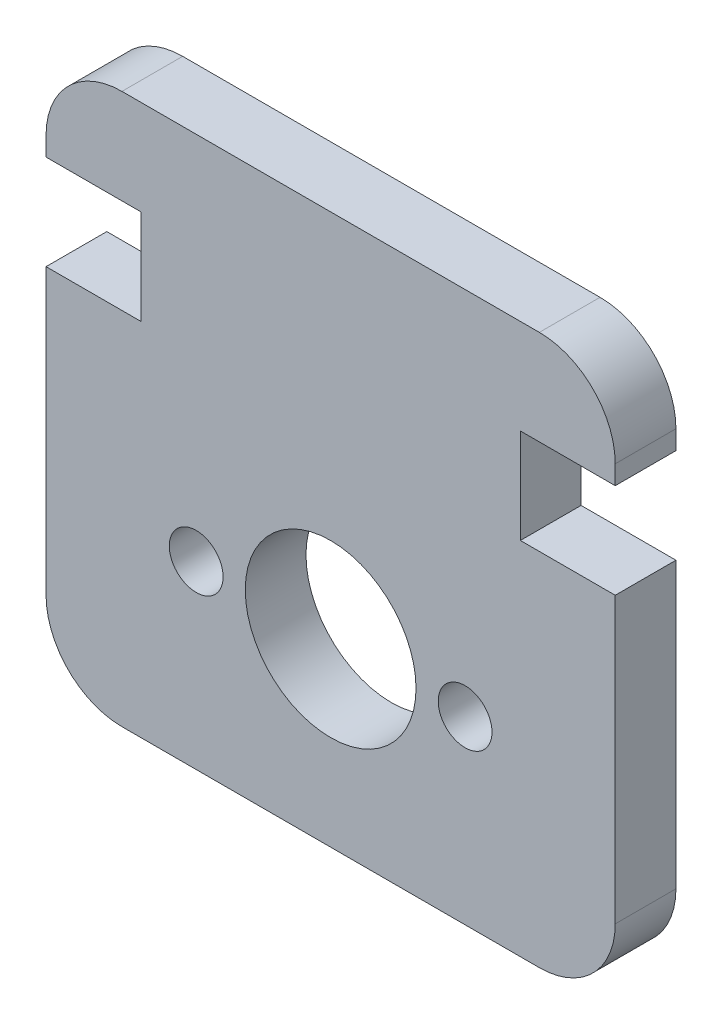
ISO-10303-21;
HEADER;
FILE_DESCRIPTION(('STEP AP214'),'2;1');
FILE_NAME('part.step','',(''),(''),'','','');
FILE_SCHEMA(('AUTOMOTIVE_DESIGN { 1 0 10303 214 1 1 1 1 }'));
ENDSEC;
DATA;
#1=APPLICATION_CONTEXT('core data for automotive mechanical design processes');
#2=APPLICATION_PROTOCOL_DEFINITION('international standard','automotive_design',2000,#1);
#3=PRODUCT_CONTEXT('',#1,'mechanical');
#4=PRODUCT('Part','Part','',(#3));
#5=PRODUCT_RELATED_PRODUCT_CATEGORY('part','',(#4));
#6=PRODUCT_DEFINITION_FORMATION('','',#4);
#7=PRODUCT_DEFINITION_CONTEXT('part definition',#1,'design');
#8=PRODUCT_DEFINITION('design','',#6,#7);
#9=PRODUCT_DEFINITION_SHAPE('','',#8);
#10=(LENGTH_UNIT() NAMED_UNIT(*) SI_UNIT(.MILLI.,.METRE.));
#11=(NAMED_UNIT(*) PLANE_ANGLE_UNIT() SI_UNIT($,.RADIAN.));
#12=(NAMED_UNIT(*) SI_UNIT($,.STERADIAN.) SOLID_ANGLE_UNIT());
#13=UNCERTAINTY_MEASURE_WITH_UNIT(LENGTH_MEASURE(1.E-05),#10,'distance_accuracy_value','');
#14=(GEOMETRIC_REPRESENTATION_CONTEXT(3) GLOBAL_UNCERTAINTY_ASSIGNED_CONTEXT((#13)) GLOBAL_UNIT_ASSIGNED_CONTEXT((#10,
#11,#12)) REPRESENTATION_CONTEXT('',''));
#15=CARTESIAN_POINT('',(0.,0.,0.));
#16=DIRECTION('',(0.,0.,1.));
#17=DIRECTION('',(1.,0.,0.));
#18=AXIS2_PLACEMENT_3D('',#15,#16,#17);
#19=CARTESIAN_POINT('',(9.525,7.62,1.016));
#20=DIRECTION('',(-1.,0.,0.));
#21=DIRECTION('',(0.,-1.,0.));
#22=AXIS2_PLACEMENT_3D('',#19,#20,#21);
#23=PLANE('',#22);
#24=DIRECTION('',(0.,1.,0.));
#25=VECTOR('',#24,1.);
#26=CARTESIAN_POINT('',(9.525,7.62,1.016));
#27=LINE('',#26,#25);
#28=CARTESIAN_POINT('',(9.525,-5.07999999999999,1.016));
#29=VERTEX_POINT('',#28);
#30=CARTESIAN_POINT('',(9.525,4.445,1.016));
#31=VERTEX_POINT('',#30);
#32=EDGE_CURVE('E276',#29,#31,#27,.T.);
#33=ORIENTED_EDGE('',*,*,#32,.F.);
#34=DIRECTION('',(0.,0.,-1.));
#35=VECTOR('',#34,1.);
#36=CARTESIAN_POINT('',(9.525,-5.08,1.016));
#37=LINE('',#36,#35);
#38=CARTESIAN_POINT('',(9.525,-5.07999999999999,-1.016));
#39=VERTEX_POINT('',#38);
#40=EDGE_CURVE('E284',#29,#39,#37,.T.);
#41=ORIENTED_EDGE('',*,*,#40,.T.);
#42=DIRECTION('',(0.,1.,0.));
#43=VECTOR('',#42,1.);
#44=CARTESIAN_POINT('',(9.525,7.62,-1.016));
#45=LINE('',#44,#43);
#46=CARTESIAN_POINT('',(9.525,4.445,-1.016));
#47=VERTEX_POINT('',#46);
#48=EDGE_CURVE('E272',#39,#47,#45,.T.);
#49=ORIENTED_EDGE('',*,*,#48,.T.);
#50=DIRECTION('',(0.,0.,1.));
#51=VECTOR('',#50,1.);
#52=CARTESIAN_POINT('',(9.525,4.445,-1.016));
#53=LINE('',#52,#51);
#54=EDGE_CURVE('E235',#47,#31,#53,.T.);
#55=ORIENTED_EDGE('',*,*,#54,.T.);
#56=EDGE_LOOP('',(#33,#41,#49,#55));
#57=FACE_BOUND('',#56,.T.);
#58=ADVANCED_FACE('F31',(#57),#23,.F.);
#59=CARTESIAN_POINT('',(-9.525,7.62,1.016));
#60=DIRECTION('',(1.,0.,0.));
#61=DIRECTION('',(0.,1.,0.));
#62=AXIS2_PLACEMENT_3D('',#59,#60,#61);
#63=PLANE('',#62);
#64=DIRECTION('',(0.,-1.,0.));
#65=VECTOR('',#64,1.);
#66=CARTESIAN_POINT('',(-9.525,7.62,-1.016));
#67=LINE('',#66,#65);
#68=CARTESIAN_POINT('',(-9.525,4.445,-1.016));
#69=VERTEX_POINT('',#68);
#70=CARTESIAN_POINT('',(-9.525,-5.08,-1.016));
#71=VERTEX_POINT('',#70);
#72=EDGE_CURVE('E286',#69,#71,#67,.T.);
#73=ORIENTED_EDGE('',*,*,#72,.T.);
#74=DIRECTION('',(0.,0.,-1.));
#75=VECTOR('',#74,1.);
#76=CARTESIAN_POINT('',(-9.525,-5.08,1.016));
#77=LINE('',#76,#75);
#78=CARTESIAN_POINT('',(-9.525,-5.08,1.016));
#79=VERTEX_POINT('',#78);
#80=EDGE_CURVE('E305',#71,#79,#77,.F.);
#81=ORIENTED_EDGE('',*,*,#80,.T.);
#82=DIRECTION('',(0.,-1.,0.));
#83=VECTOR('',#82,1.);
#84=CARTESIAN_POINT('',(-9.525,7.62,1.016));
#85=LINE('',#84,#83);
#86=CARTESIAN_POINT('',(-9.525,4.445,1.016));
#87=VERTEX_POINT('',#86);
#88=EDGE_CURVE('E278',#87,#79,#85,.T.);
#89=ORIENTED_EDGE('',*,*,#88,.F.);
#90=DIRECTION('',(0.,0.,1.));
#91=VECTOR('',#90,1.);
#92=CARTESIAN_POINT('',(-9.525,4.445,-1.016));
#93=LINE('',#92,#91);
#94=EDGE_CURVE('E245',#69,#87,#93,.T.);
#95=ORIENTED_EDGE('',*,*,#94,.F.);
#96=EDGE_LOOP('',(#73,#81,#89,#95));
#97=FACE_BOUND('',#96,.T.);
#98=ADVANCED_FACE('F309',(#97),#63,.F.);
#99=CARTESIAN_POINT('',(-9.525,-7.62,1.016));
#100=DIRECTION('',(0.,1.,0.));
#101=DIRECTION('',(0.,0.,1.));
#102=AXIS2_PLACEMENT_3D('',#99,#100,#101);
#103=PLANE('',#102);
#104=DIRECTION('',(1.,0.,0.));
#105=VECTOR('',#104,1.);
#106=CARTESIAN_POINT('',(-9.525,-7.62,-1.016));
#107=LINE('',#106,#105);
#108=CARTESIAN_POINT('',(-6.985,-7.62,-1.016));
#109=VERTEX_POINT('',#108);
#110=CARTESIAN_POINT('',(6.985,-7.62,-1.016));
#111=VERTEX_POINT('',#110);
#112=EDGE_CURVE('E279',#109,#111,#107,.T.);
#113=ORIENTED_EDGE('',*,*,#112,.T.);
#114=DIRECTION('',(0.,0.,-1.));
#115=VECTOR('',#114,1.);
#116=CARTESIAN_POINT('',(6.985,-7.62,1.016));
#117=LINE('',#116,#115);
#118=CARTESIAN_POINT('',(6.985,-7.62,1.016));
#119=VERTEX_POINT('',#118);
#120=EDGE_CURVE('E300',#111,#119,#117,.F.);
#121=ORIENTED_EDGE('',*,*,#120,.T.);
#122=DIRECTION('',(1.,0.,0.));
#123=VECTOR('',#122,1.);
#124=CARTESIAN_POINT('',(-9.525,-7.62,1.016));
#125=LINE('',#124,#123);
#126=CARTESIAN_POINT('',(-6.985,-7.62,1.016));
#127=VERTEX_POINT('',#126);
#128=EDGE_CURVE('E281',#127,#119,#125,.T.);
#129=ORIENTED_EDGE('',*,*,#128,.F.);
#130=DIRECTION('',(0.,0.,-1.));
#131=VECTOR('',#130,1.);
#132=CARTESIAN_POINT('',(-6.985,-7.62,1.016));
#133=LINE('',#132,#131);
#134=EDGE_CURVE('E297',#127,#109,#133,.T.);
#135=ORIENTED_EDGE('',*,*,#134,.T.);
#136=EDGE_LOOP('',(#113,#121,#129,#135));
#137=FACE_BOUND('',#136,.T.);
#138=ADVANCED_FACE('F319',(#137),#103,.F.);
#139=CARTESIAN_POINT('',(9.52500000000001,-7.62,1.016));
#140=DIRECTION('',(0.,0.,1.));
#141=DIRECTION('',(1.,0.,0.));
#142=AXIS2_PLACEMENT_3D('',#139,#140,#141);
#143=PLANE('',#142);
#144=CARTESIAN_POINT('',(-4.4999999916,-1.5875,1.016));
#145=DIRECTION('',(0.,0.,1.));
#146=DIRECTION('',(1.,0.,0.));
#147=AXIS2_PLACEMENT_3D('',#144,#145,#146);
#148=CIRCLE('',#147,0.899999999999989);
#149=CARTESIAN_POINT('',(-3.59999999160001,-1.5875,1.016));
#150=VERTEX_POINT('',#149);
#151=EDGE_CURVE('E192',#150,#150,#148,.T.);
#152=ORIENTED_EDGE('',*,*,#151,.F.);
#153=EDGE_LOOP('',(#152));
#154=FACE_BOUND('',#153,.T.);
#155=CARTESIAN_POINT('',(4.500000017,-1.5875,1.016));
#156=DIRECTION('',(0.,0.,1.));
#157=DIRECTION('',(1.,0.,0.));
#158=AXIS2_PLACEMENT_3D('',#155,#156,#157);
#159=CIRCLE('',#158,0.899999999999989);
#160=CARTESIAN_POINT('',(5.40000001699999,-1.5875,1.016));
#161=VERTEX_POINT('',#160);
#162=EDGE_CURVE('E343',#161,#161,#159,.T.);
#163=ORIENTED_EDGE('',*,*,#162,.F.);
#164=EDGE_LOOP('',(#163));
#165=FACE_BOUND('',#164,.T.);
#166=DIRECTION('',(-1.,0.,0.));
#167=VECTOR('',#166,1.);
#168=CARTESIAN_POINT('',(-9.525,10.795,1.016));
#169=LINE('',#168,#167);
#170=CARTESIAN_POINT('',(6.98499999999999,10.795,1.016));
#171=VERTEX_POINT('',#170);
#172=CARTESIAN_POINT('',(-6.985,10.795,1.016));
#173=VERTEX_POINT('',#172);
#174=EDGE_CURVE('E153',#171,#173,#169,.T.);
#175=ORIENTED_EDGE('',*,*,#174,.T.);
#176=CARTESIAN_POINT('',(-6.985,8.255,1.016));
#177=DIRECTION('',(0.,0.,1.));
#178=DIRECTION('',(1.,0.,0.));
#179=AXIS2_PLACEMENT_3D('',#176,#177,#178);
#180=CIRCLE('',#179,2.54);
#181=CARTESIAN_POINT('',(-9.525,8.255,1.016));
#182=VERTEX_POINT('',#181);
#183=EDGE_CURVE('E210',#173,#182,#180,.T.);
#184=ORIENTED_EDGE('',*,*,#183,.T.);
#185=DIRECTION('',(0.,-1.,0.));
#186=VECTOR('',#185,1.);
#187=CARTESIAN_POINT('',(-9.525,7.62,1.016));
#188=LINE('',#187,#186);
#189=CARTESIAN_POINT('',(-9.525,7.62,1.016));
#190=VERTEX_POINT('',#189);
#191=EDGE_CURVE('E184',#182,#190,#188,.T.);
#192=ORIENTED_EDGE('',*,*,#191,.T.);
#193=DIRECTION('',(1.,0.,0.));
#194=VECTOR('',#193,1.);
#195=CARTESIAN_POINT('',(-9.525,7.62,1.016));
#196=LINE('',#195,#194);
#197=CARTESIAN_POINT('',(-6.35,7.62,1.016));
#198=VERTEX_POINT('',#197);
#199=EDGE_CURVE('E161',#190,#198,#196,.T.);
#200=ORIENTED_EDGE('',*,*,#199,.T.);
#201=DIRECTION('',(0.,1.,0.));
#202=VECTOR('',#201,1.);
#203=CARTESIAN_POINT('',(-6.35,7.62,1.016));
#204=LINE('',#203,#202);
#205=CARTESIAN_POINT('',(-6.35,4.445,1.016));
#206=VERTEX_POINT('',#205);
#207=EDGE_CURVE('E226',#206,#198,#204,.T.);
#208=ORIENTED_EDGE('',*,*,#207,.F.);
#209=DIRECTION('',(1.,0.,0.));
#210=VECTOR('',#209,1.);
#211=CARTESIAN_POINT('',(-9.525,4.445,1.016));
#212=LINE('',#211,#210);
#213=EDGE_CURVE('E229',#87,#206,#212,.T.);
#214=ORIENTED_EDGE('',*,*,#213,.F.);
#215=ORIENTED_EDGE('',*,*,#88,.T.);
#216=CARTESIAN_POINT('',(-6.985,-5.08,1.016));
#217=DIRECTION('',(0.,0.,1.));
#218=DIRECTION('',(1.,0.,0.));
#219=AXIS2_PLACEMENT_3D('',#216,#217,#218);
#220=CIRCLE('',#219,2.54);
#221=EDGE_CURVE('E302',#79,#127,#220,.T.);
#222=ORIENTED_EDGE('',*,*,#221,.T.);
#223=ORIENTED_EDGE('',*,*,#128,.T.);
#224=CARTESIAN_POINT('',(6.985,-5.08,1.016));
#225=DIRECTION('',(0.,0.,1.));
#226=DIRECTION('',(1.,0.,0.));
#227=AXIS2_PLACEMENT_3D('',#224,#225,#226);
#228=CIRCLE('',#227,2.54);
#229=EDGE_CURVE('E304',#119,#29,#228,.T.);
#230=ORIENTED_EDGE('',*,*,#229,.T.);
#231=ORIENTED_EDGE('',*,*,#32,.T.);
#232=DIRECTION('',(1.,0.,0.));
#233=VECTOR('',#232,1.);
#234=CARTESIAN_POINT('',(9.525,4.445,1.016));
#235=LINE('',#234,#233);
#236=CARTESIAN_POINT('',(6.35,4.445,1.016));
#237=VERTEX_POINT('',#236);
#238=EDGE_CURVE('E252',#237,#31,#235,.T.);
#239=ORIENTED_EDGE('',*,*,#238,.F.);
#240=DIRECTION('',(0.,-1.,0.));
#241=VECTOR('',#240,1.);
#242=CARTESIAN_POINT('',(6.35,7.62,1.016));
#243=LINE('',#242,#241);
#244=CARTESIAN_POINT('',(6.35,7.62,1.016));
#245=VERTEX_POINT('',#244);
#246=EDGE_CURVE('E259',#245,#237,#243,.T.);
#247=ORIENTED_EDGE('',*,*,#246,.F.);
#248=CARTESIAN_POINT('',(9.525,7.62,1.016));
#249=VERTEX_POINT('',#248);
#250=EDGE_CURVE('E175',#245,#249,#196,.T.);
#251=ORIENTED_EDGE('',*,*,#250,.T.);
#252=DIRECTION('',(0.,1.,0.));
#253=VECTOR('',#252,1.);
#254=CARTESIAN_POINT('',(9.525,7.62,1.016));
#255=LINE('',#254,#253);
#256=CARTESIAN_POINT('',(9.525,8.255,1.016));
#257=VERTEX_POINT('',#256);
#258=EDGE_CURVE('E187',#249,#257,#255,.T.);
#259=ORIENTED_EDGE('',*,*,#258,.T.);
#260=CARTESIAN_POINT('',(6.985,8.255,1.016));
#261=DIRECTION('',(0.,0.,1.));
#262=DIRECTION('',(1.,0.,0.));
#263=AXIS2_PLACEMENT_3D('',#260,#261,#262);
#264=CIRCLE('',#263,2.54);
#265=EDGE_CURVE('E200',#257,#171,#264,.T.);
#266=ORIENTED_EDGE('',*,*,#265,.T.);
#267=EDGE_LOOP('',(#175,#184,#192,#200,#208,#214,#215,#222,#223,#230,#231,#239,#247,#251,#259,#266));
#268=FACE_BOUND('',#267,.T.);
#269=CARTESIAN_POINT('',(0.,-1.5875,1.016));
#270=DIRECTION('',(0.,0.,1.));
#271=DIRECTION('',(1.,0.,0.));
#272=AXIS2_PLACEMENT_3D('',#269,#270,#271);
#273=CIRCLE('',#272,2.8575);
#274=CARTESIAN_POINT('',(2.8575,-1.5875,1.016));
#275=VERTEX_POINT('',#274);
#276=EDGE_CURVE('E273',#275,#275,#273,.T.);
#277=ORIENTED_EDGE('',*,*,#276,.F.);
#278=EDGE_LOOP('',(#277));
#279=FACE_BOUND('',#278,.T.);
#280=ADVANCED_FACE('F198',(#154,#165,#268,#279),#143,.T.);
#281=CARTESIAN_POINT('',(9.52500000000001,-7.62,-1.016));
#282=DIRECTION('',(0.,0.,1.));
#283=DIRECTION('',(1.,0.,0.));
#284=AXIS2_PLACEMENT_3D('',#281,#282,#283);
#285=PLANE('',#284);
#286=CARTESIAN_POINT('',(-4.4999999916,-1.5875,-1.016));
#287=DIRECTION('',(0.,0.,1.));
#288=DIRECTION('',(1.,0.,0.));
#289=AXIS2_PLACEMENT_3D('',#286,#287,#288);
#290=CIRCLE('',#289,0.9);
#291=CARTESIAN_POINT('',(-3.5999999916,-1.5875,-1.016));
#292=VERTEX_POINT('',#291);
#293=EDGE_CURVE('E346',#292,#292,#290,.T.);
#294=ORIENTED_EDGE('',*,*,#293,.T.);
#295=EDGE_LOOP('',(#294));
#296=FACE_BOUND('',#295,.T.);
#297=CARTESIAN_POINT('',(4.500000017,-1.5875,-1.016));
#298=DIRECTION('',(0.,0.,1.));
#299=DIRECTION('',(1.,0.,0.));
#300=AXIS2_PLACEMENT_3D('',#297,#298,#299);
#301=CIRCLE('',#300,0.9);
#302=CARTESIAN_POINT('',(5.400000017,-1.5875,-1.016));
#303=VERTEX_POINT('',#302);
#304=EDGE_CURVE('E338',#303,#303,#301,.T.);
#305=ORIENTED_EDGE('',*,*,#304,.T.);
#306=EDGE_LOOP('',(#305));
#307=FACE_BOUND('',#306,.T.);
#308=CARTESIAN_POINT('',(0.,-1.5875,-1.016));
#309=DIRECTION('',(0.,0.,1.));
#310=DIRECTION('',(1.,0.,0.));
#311=AXIS2_PLACEMENT_3D('',#308,#309,#310);
#312=CIRCLE('',#311,2.8575);
#313=CARTESIAN_POINT('',(2.8575,-1.5875,-1.016));
#314=VERTEX_POINT('',#313);
#315=EDGE_CURVE('E269',#314,#314,#312,.T.);
#316=ORIENTED_EDGE('',*,*,#315,.T.);
#317=EDGE_LOOP('',(#316));
#318=FACE_BOUND('',#317,.T.);
#319=DIRECTION('',(0.,-1.,0.));
#320=VECTOR('',#319,1.);
#321=CARTESIAN_POINT('',(-9.525,7.62,-1.016));
#322=LINE('',#321,#320);
#323=CARTESIAN_POINT('',(-9.525,8.255,-1.016));
#324=VERTEX_POINT('',#323);
#325=CARTESIAN_POINT('',(-9.525,7.62,-1.016));
#326=VERTEX_POINT('',#325);
#327=EDGE_CURVE('E145',#324,#326,#322,.T.);
#328=ORIENTED_EDGE('',*,*,#327,.F.);
#329=CARTESIAN_POINT('',(-6.985,8.255,-1.016));
#330=DIRECTION('',(0.,0.,1.));
#331=DIRECTION('',(1.,0.,0.));
#332=AXIS2_PLACEMENT_3D('',#329,#330,#331);
#333=CIRCLE('',#332,2.54);
#334=CARTESIAN_POINT('',(-6.985,10.795,-1.016));
#335=VERTEX_POINT('',#334);
#336=EDGE_CURVE('E39',#324,#335,#333,.F.);
#337=ORIENTED_EDGE('',*,*,#336,.T.);
#338=DIRECTION('',(-1.,0.,0.));
#339=VECTOR('',#338,1.);
#340=CARTESIAN_POINT('',(-9.525,10.795,-1.016));
#341=LINE('',#340,#339);
#342=CARTESIAN_POINT('',(6.98499999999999,10.795,-1.016));
#343=VERTEX_POINT('',#342);
#344=EDGE_CURVE('E163',#343,#335,#341,.T.);
#345=ORIENTED_EDGE('',*,*,#344,.F.);
#346=CARTESIAN_POINT('',(6.985,8.255,-1.016));
#347=DIRECTION('',(0.,0.,1.));
#348=DIRECTION('',(1.,0.,0.));
#349=AXIS2_PLACEMENT_3D('',#346,#347,#348);
#350=CIRCLE('',#349,2.54);
#351=CARTESIAN_POINT('',(9.525,8.255,-1.016));
#352=VERTEX_POINT('',#351);
#353=EDGE_CURVE('E46',#343,#352,#350,.F.);
#354=ORIENTED_EDGE('',*,*,#353,.T.);
#355=DIRECTION('',(0.,1.,0.));
#356=VECTOR('',#355,1.);
#357=CARTESIAN_POINT('',(9.525,7.62,-1.016));
#358=LINE('',#357,#356);
#359=CARTESIAN_POINT('',(9.525,7.62,-1.016));
#360=VERTEX_POINT('',#359);
#361=EDGE_CURVE('E169',#360,#352,#358,.T.);
#362=ORIENTED_EDGE('',*,*,#361,.F.);
#363=DIRECTION('',(1.,0.,0.));
#364=VECTOR('',#363,1.);
#365=CARTESIAN_POINT('',(-9.525,7.62,-1.016));
#366=LINE('',#365,#364);
#367=CARTESIAN_POINT('',(6.35,7.62,-1.016));
#368=VERTEX_POINT('',#367);
#369=EDGE_CURVE('E152',#368,#360,#366,.T.);
#370=ORIENTED_EDGE('',*,*,#369,.F.);
#371=DIRECTION('',(0.,-1.,0.));
#372=VECTOR('',#371,1.);
#373=CARTESIAN_POINT('',(6.35,7.62,-1.016));
#374=LINE('',#373,#372);
#375=CARTESIAN_POINT('',(6.35,4.445,-1.016));
#376=VERTEX_POINT('',#375);
#377=EDGE_CURVE('E248',#368,#376,#374,.T.);
#378=ORIENTED_EDGE('',*,*,#377,.T.);
#379=DIRECTION('',(1.,0.,0.));
#380=VECTOR('',#379,1.);
#381=CARTESIAN_POINT('',(9.525,4.445,-1.016));
#382=LINE('',#381,#380);
#383=EDGE_CURVE('E251',#376,#47,#382,.T.);
#384=ORIENTED_EDGE('',*,*,#383,.T.);
#385=ORIENTED_EDGE('',*,*,#48,.F.);
#386=CARTESIAN_POINT('',(6.985,-5.08,-1.016));
#387=DIRECTION('',(0.,0.,1.));
#388=DIRECTION('',(1.,0.,0.));
#389=AXIS2_PLACEMENT_3D('',#386,#387,#388);
#390=CIRCLE('',#389,2.54);
#391=EDGE_CURVE('E295',#39,#111,#390,.F.);
#392=ORIENTED_EDGE('',*,*,#391,.T.);
#393=ORIENTED_EDGE('',*,*,#112,.F.);
#394=CARTESIAN_POINT('',(-6.985,-5.08,-1.016));
#395=DIRECTION('',(0.,0.,1.));
#396=DIRECTION('',(1.,0.,0.));
#397=AXIS2_PLACEMENT_3D('',#394,#395,#396);
#398=CIRCLE('',#397,2.54);
#399=EDGE_CURVE('E293',#109,#71,#398,.F.);
#400=ORIENTED_EDGE('',*,*,#399,.T.);
#401=ORIENTED_EDGE('',*,*,#72,.F.);
#402=DIRECTION('',(1.,0.,0.));
#403=VECTOR('',#402,1.);
#404=CARTESIAN_POINT('',(-9.525,4.445,-1.016));
#405=LINE('',#404,#403);
#406=CARTESIAN_POINT('',(-6.35,4.445,-1.016));
#407=VERTEX_POINT('',#406);
#408=EDGE_CURVE('E232',#69,#407,#405,.T.);
#409=ORIENTED_EDGE('',*,*,#408,.T.);
#410=DIRECTION('',(0.,1.,0.));
#411=VECTOR('',#410,1.);
#412=CARTESIAN_POINT('',(-6.35,7.62,-1.016));
#413=LINE('',#412,#411);
#414=CARTESIAN_POINT('',(-6.35,7.62,-1.016));
#415=VERTEX_POINT('',#414);
#416=EDGE_CURVE('E168',#407,#415,#413,.T.);
#417=ORIENTED_EDGE('',*,*,#416,.T.);
#418=EDGE_CURVE('E159',#326,#415,#366,.T.);
#419=ORIENTED_EDGE('',*,*,#418,.F.);
#420=EDGE_LOOP('',(#328,#337,#345,#354,#362,#370,#378,#384,#385,#392,#393,#400,#401,#409,#417,#419));
#421=FACE_BOUND('',#420,.T.);
#422=ADVANCED_FACE('F166',(#296,#307,#318,#421),#285,.F.);
#423=CARTESIAN_POINT('',(0.,-1.5875,-1.016));
#424=DIRECTION('',(0.,0.,1.));
#425=DIRECTION('',(1.,0.,0.));
#426=AXIS2_PLACEMENT_3D('',#423,#424,#425);
#427=CYLINDRICAL_SURFACE('',#426,2.8575);
#428=ORIENTED_EDGE('',*,*,#315,.F.);
#429=EDGE_LOOP('',(#428));
#430=FACE_BOUND('',#429,.T.);
#431=ORIENTED_EDGE('',*,*,#276,.T.);
#432=EDGE_LOOP('',(#431));
#433=FACE_BOUND('',#432,.T.);
#434=ADVANCED_FACE('F447',(#430,#433),#427,.F.);
#435=CARTESIAN_POINT('',(-6.35,7.62,-1.016));
#436=DIRECTION('',(1.,0.,0.));
#437=DIRECTION('',(0.,0.,-1.));
#438=AXIS2_PLACEMENT_3D('',#435,#436,#437);
#439=PLANE('',#438);
#440=ORIENTED_EDGE('',*,*,#207,.T.);
#441=DIRECTION('',(0.,0.,1.));
#442=VECTOR('',#441,1.);
#443=CARTESIAN_POINT('',(-6.35,7.62,-1.016));
#444=LINE('',#443,#442);
#445=EDGE_CURVE('E239',#415,#198,#444,.T.);
#446=ORIENTED_EDGE('',*,*,#445,.F.);
#447=ORIENTED_EDGE('',*,*,#416,.F.);
#448=DIRECTION('',(0.,0.,1.));
#449=VECTOR('',#448,1.);
#450=CARTESIAN_POINT('',(-6.35,4.445,-1.016));
#451=LINE('',#450,#449);
#452=EDGE_CURVE('E266',#407,#206,#451,.T.);
#453=ORIENTED_EDGE('',*,*,#452,.T.);
#454=EDGE_LOOP('',(#440,#446,#447,#453));
#455=FACE_BOUND('',#454,.T.);
#456=ADVANCED_FACE('F466',(#455),#439,.F.);
#457=CARTESIAN_POINT('',(-9.525,4.445,-1.016));
#458=DIRECTION('',(0.,-1.,0.));
#459=DIRECTION('',(0.,0.,-1.));
#460=AXIS2_PLACEMENT_3D('',#457,#458,#459);
#461=PLANE('',#460);
#462=ORIENTED_EDGE('',*,*,#213,.T.);
#463=ORIENTED_EDGE('',*,*,#452,.F.);
#464=ORIENTED_EDGE('',*,*,#408,.F.);
#465=ORIENTED_EDGE('',*,*,#94,.T.);
#466=EDGE_LOOP('',(#462,#463,#464,#465));
#467=FACE_BOUND('',#466,.T.);
#468=ADVANCED_FACE('F475',(#467),#461,.F.);
#469=CARTESIAN_POINT('',(9.525,4.445,-1.016));
#470=DIRECTION('',(0.,-1.,0.));
#471=DIRECTION('',(0.,0.,-1.));
#472=AXIS2_PLACEMENT_3D('',#469,#470,#471);
#473=PLANE('',#472);
#474=ORIENTED_EDGE('',*,*,#238,.T.);
#475=ORIENTED_EDGE('',*,*,#54,.F.);
#476=ORIENTED_EDGE('',*,*,#383,.F.);
#477=DIRECTION('',(0.,0.,1.));
#478=VECTOR('',#477,1.);
#479=CARTESIAN_POINT('',(6.35,4.445,-1.016));
#480=LINE('',#479,#478);
#481=EDGE_CURVE('E258',#376,#237,#480,.T.);
#482=ORIENTED_EDGE('',*,*,#481,.T.);
#483=EDGE_LOOP('',(#474,#475,#476,#482));
#484=FACE_BOUND('',#483,.T.);
#485=ADVANCED_FACE('F334',(#484),#473,.F.);
#486=CARTESIAN_POINT('',(6.35,7.62,-1.016));
#487=DIRECTION('',(-1.,0.,0.));
#488=DIRECTION('',(0.,0.,1.));
#489=AXIS2_PLACEMENT_3D('',#486,#487,#488);
#490=PLANE('',#489);
#491=ORIENTED_EDGE('',*,*,#246,.T.);
#492=ORIENTED_EDGE('',*,*,#481,.F.);
#493=ORIENTED_EDGE('',*,*,#377,.F.);
#494=DIRECTION('',(0.,0.,1.));
#495=VECTOR('',#494,1.);
#496=CARTESIAN_POINT('',(6.35,7.62,-1.016));
#497=LINE('',#496,#495);
#498=EDGE_CURVE('E255',#368,#245,#497,.T.);
#499=ORIENTED_EDGE('',*,*,#498,.T.);
#500=EDGE_LOOP('',(#491,#492,#493,#499));
#501=FACE_BOUND('',#500,.T.);
#502=ADVANCED_FACE('F360',(#501),#490,.F.);
#503=CARTESIAN_POINT('',(4.500000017,-1.5875,1.016));
#504=DIRECTION('',(0.,0.,1.));
#505=DIRECTION('',(1.,0.,0.));
#506=AXIS2_PLACEMENT_3D('',#503,#504,#505);
#507=CYLINDRICAL_SURFACE('',#506,0.899999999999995);
#508=ORIENTED_EDGE('',*,*,#304,.F.);
#509=EDGE_LOOP('',(#508));
#510=FACE_BOUND('',#509,.T.);
#511=ORIENTED_EDGE('',*,*,#162,.T.);
#512=EDGE_LOOP('',(#511));
#513=FACE_BOUND('',#512,.T.);
#514=ADVANCED_FACE('F358',(#510,#513),#507,.F.);
#515=CARTESIAN_POINT('',(-4.4999999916,-1.5875,1.016));
#516=DIRECTION('',(0.,0.,1.));
#517=DIRECTION('',(1.,0.,0.));
#518=AXIS2_PLACEMENT_3D('',#515,#516,#517);
#519=CYLINDRICAL_SURFACE('',#518,0.899999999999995);
#520=ORIENTED_EDGE('',*,*,#293,.F.);
#521=EDGE_LOOP('',(#520));
#522=FACE_BOUND('',#521,.T.);
#523=ORIENTED_EDGE('',*,*,#151,.T.);
#524=EDGE_LOOP('',(#523));
#525=FACE_BOUND('',#524,.T.);
#526=ADVANCED_FACE('F351',(#522,#525),#519,.F.);
#527=CARTESIAN_POINT('',(6.985,-5.08,1.016));
#528=DIRECTION('',(0.,0.,-1.));
#529=DIRECTION('',(-1.,0.,0.));
#530=AXIS2_PLACEMENT_3D('',#527,#528,#529);
#531=CYLINDRICAL_SURFACE('',#530,2.54);
#532=ORIENTED_EDGE('',*,*,#229,.F.);
#533=ORIENTED_EDGE('',*,*,#120,.F.);
#534=ORIENTED_EDGE('',*,*,#391,.F.);
#535=ORIENTED_EDGE('',*,*,#40,.F.);
#536=EDGE_LOOP('',(#532,#533,#534,#535));
#537=FACE_BOUND('',#536,.T.);
#538=ADVANCED_FACE('F326',(#537),#531,.T.);
#539=CARTESIAN_POINT('',(-6.985,-5.08,1.016));
#540=DIRECTION('',(0.,0.,-1.));
#541=DIRECTION('',(-1.,0.,0.));
#542=AXIS2_PLACEMENT_3D('',#539,#540,#541);
#543=CYLINDRICAL_SURFACE('',#542,2.54);
#544=ORIENTED_EDGE('',*,*,#221,.F.);
#545=ORIENTED_EDGE('',*,*,#80,.F.);
#546=ORIENTED_EDGE('',*,*,#399,.F.);
#547=ORIENTED_EDGE('',*,*,#134,.F.);
#548=EDGE_LOOP('',(#544,#545,#546,#547));
#549=FACE_BOUND('',#548,.T.);
#550=ADVANCED_FACE('F316',(#549),#543,.T.);
#551=CARTESIAN_POINT('',(-9.525,7.62,-1.016));
#552=DIRECTION('',(0.,-1.,0.));
#553=DIRECTION('',(0.,0.,-1.));
#554=AXIS2_PLACEMENT_3D('',#551,#552,#553);
#555=PLANE('',#554);
#556=ORIENTED_EDGE('',*,*,#498,.F.);
#557=ORIENTED_EDGE('',*,*,#369,.T.);
#558=DIRECTION('',(0.,0.,1.));
#559=VECTOR('',#558,1.);
#560=CARTESIAN_POINT('',(9.525,7.62,-1.016));
#561=LINE('',#560,#559);
#562=EDGE_CURVE('E162',#360,#249,#561,.T.);
#563=ORIENTED_EDGE('',*,*,#562,.T.);
#564=ORIENTED_EDGE('',*,*,#250,.F.);
#565=EDGE_LOOP('',(#556,#557,#563,#564));
#566=FACE_BOUND('',#565,.T.);
#567=ADVANCED_FACE('F384',(#566),#555,.T.);
#568=CARTESIAN_POINT('',(-9.525,7.62,-1.016));
#569=DIRECTION('',(-1.,0.,0.));
#570=DIRECTION('',(0.,0.,1.));
#571=AXIS2_PLACEMENT_3D('',#568,#569,#570);
#572=PLANE('',#571);
#573=ORIENTED_EDGE('',*,*,#191,.F.);
#574=DIRECTION('',(0.,0.,1.));
#575=VECTOR('',#574,1.);
#576=CARTESIAN_POINT('',(-9.525,8.255,-1.016));
#577=LINE('',#576,#575);
#578=EDGE_CURVE('E54',#182,#324,#577,.F.);
#579=ORIENTED_EDGE('',*,*,#578,.T.);
#580=ORIENTED_EDGE('',*,*,#327,.T.);
#581=DIRECTION('',(0.,0.,1.));
#582=VECTOR('',#581,1.);
#583=CARTESIAN_POINT('',(-9.525,7.62,-1.016));
#584=LINE('',#583,#582);
#585=EDGE_CURVE('E148',#326,#190,#584,.T.);
#586=ORIENTED_EDGE('',*,*,#585,.T.);
#587=EDGE_LOOP('',(#573,#579,#580,#586));
#588=FACE_BOUND('',#587,.T.);
#589=ADVANCED_FACE('F147',(#588),#572,.T.);
#590=CARTESIAN_POINT('',(-9.525,10.795,-1.016));
#591=DIRECTION('',(0.,1.,0.));
#592=DIRECTION('',(0.,0.,1.));
#593=AXIS2_PLACEMENT_3D('',#590,#591,#592);
#594=PLANE('',#593);
#595=ORIENTED_EDGE('',*,*,#344,.T.);
#596=DIRECTION('',(0.,0.,1.));
#597=VECTOR('',#596,1.);
#598=CARTESIAN_POINT('',(-6.985,10.795,-1.016));
#599=LINE('',#598,#597);
#600=EDGE_CURVE('E211',#335,#173,#599,.T.);
#601=ORIENTED_EDGE('',*,*,#600,.T.);
#602=ORIENTED_EDGE('',*,*,#174,.F.);
#603=DIRECTION('',(0.,0.,1.));
#604=VECTOR('',#603,1.);
#605=CARTESIAN_POINT('',(6.985,10.795,-1.016));
#606=LINE('',#605,#604);
#607=EDGE_CURVE('E209',#171,#343,#606,.F.);
#608=ORIENTED_EDGE('',*,*,#607,.T.);
#609=EDGE_LOOP('',(#595,#601,#602,#608));
#610=FACE_BOUND('',#609,.T.);
#611=ADVANCED_FACE('F222',(#610),#594,.T.);
#612=CARTESIAN_POINT('',(9.525,7.62,-1.016));
#613=DIRECTION('',(1.,0.,0.));
#614=DIRECTION('',(0.,0.,-1.));
#615=AXIS2_PLACEMENT_3D('',#612,#613,#614);
#616=PLANE('',#615);
#617=ORIENTED_EDGE('',*,*,#361,.T.);
#618=DIRECTION('',(0.,0.,1.));
#619=VECTOR('',#618,1.);
#620=CARTESIAN_POINT('',(9.525,8.255,-1.016));
#621=LINE('',#620,#619);
#622=EDGE_CURVE('E11',#352,#257,#621,.T.);
#623=ORIENTED_EDGE('',*,*,#622,.T.);
#624=ORIENTED_EDGE('',*,*,#258,.F.);
#625=ORIENTED_EDGE('',*,*,#562,.F.);
#626=EDGE_LOOP('',(#617,#623,#624,#625));
#627=FACE_BOUND('',#626,.T.);
#628=ADVANCED_FACE('F205',(#627),#616,.T.);
#629=ORIENTED_EDGE('',*,*,#418,.T.);
#630=ORIENTED_EDGE('',*,*,#445,.T.);
#631=ORIENTED_EDGE('',*,*,#199,.F.);
#632=ORIENTED_EDGE('',*,*,#585,.F.);
#633=EDGE_LOOP('',(#629,#630,#631,#632));
#634=FACE_BOUND('',#633,.T.);
#635=ADVANCED_FACE('F157',(#634),#555,.T.);
#636=CARTESIAN_POINT('',(-6.985,8.255,-1.016));
#637=DIRECTION('',(0.,0.,1.));
#638=DIRECTION('',(1.,0.,0.));
#639=AXIS2_PLACEMENT_3D('',#636,#637,#638);
#640=CYLINDRICAL_SURFACE('',#639,2.54);
#641=ORIENTED_EDGE('',*,*,#336,.F.);
#642=ORIENTED_EDGE('',*,*,#578,.F.);
#643=ORIENTED_EDGE('',*,*,#183,.F.);
#644=ORIENTED_EDGE('',*,*,#600,.F.);
#645=EDGE_LOOP('',(#641,#642,#643,#644));
#646=FACE_BOUND('',#645,.T.);
#647=ADVANCED_FACE('F223',(#646),#640,.T.);
#648=CARTESIAN_POINT('',(6.985,8.255,-1.016));
#649=DIRECTION('',(0.,0.,1.));
#650=DIRECTION('',(1.,0.,0.));
#651=AXIS2_PLACEMENT_3D('',#648,#649,#650);
#652=CYLINDRICAL_SURFACE('',#651,2.54);
#653=ORIENTED_EDGE('',*,*,#353,.F.);
#654=ORIENTED_EDGE('',*,*,#607,.F.);
#655=ORIENTED_EDGE('',*,*,#265,.F.);
#656=ORIENTED_EDGE('',*,*,#622,.F.);
#657=EDGE_LOOP('',(#653,#654,#655,#656));
#658=FACE_BOUND('',#657,.T.);
#659=ADVANCED_FACE('F33',(#658),#652,.T.);
#660=CLOSED_SHELL('',(#58,#98,#138,#280,#422,#434,#456,#468,#485,#502,#514,#526,#538,#550,#567,
#589,#611,#628,#635,#647,#659));
#661=MANIFOLD_SOLID_BREP('B2',#660);
#662=ADVANCED_BREP_SHAPE_REPRESENTATION('',(#18,#661),#14);
#663=SHAPE_DEFINITION_REPRESENTATION(#9,#662);
ENDSEC;
END-ISO-10303-21;
